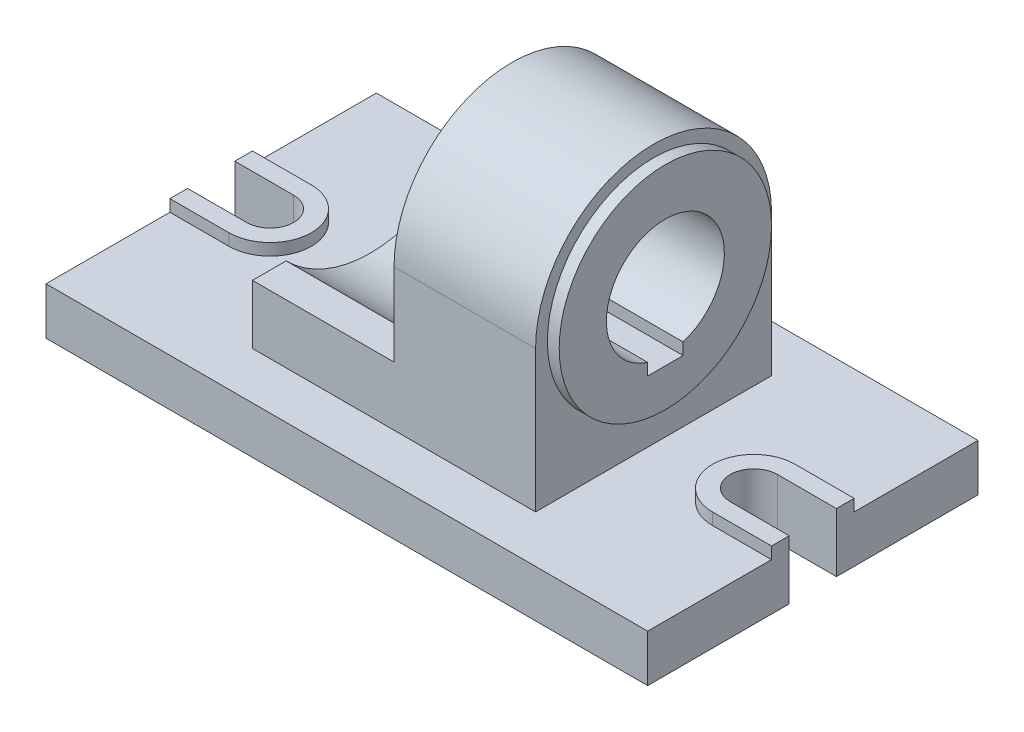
ISO-10303-21;
HEADER;
FILE_DESCRIPTION(('STEP AP214'),'2;1');
FILE_NAME('part.step','',(''),(''),'','','');
FILE_SCHEMA(('AUTOMOTIVE_DESIGN { 1 0 10303 214 1 1 1 1 }'));
ENDSEC;
DATA;
#1=APPLICATION_CONTEXT('core data for automotive mechanical design processes');
#2=APPLICATION_PROTOCOL_DEFINITION('international standard','automotive_design',2000,#1);
#3=PRODUCT_CONTEXT('',#1,'mechanical');
#4=PRODUCT('Part','Part','',(#3));
#5=PRODUCT_RELATED_PRODUCT_CATEGORY('part','',(#4));
#6=PRODUCT_DEFINITION_FORMATION('','',#4);
#7=PRODUCT_DEFINITION_CONTEXT('part definition',#1,'design');
#8=PRODUCT_DEFINITION('design','',#6,#7);
#9=PRODUCT_DEFINITION_SHAPE('','',#8);
#10=(LENGTH_UNIT() NAMED_UNIT(*) SI_UNIT(.MILLI.,.METRE.));
#11=(NAMED_UNIT(*) PLANE_ANGLE_UNIT() SI_UNIT($,.RADIAN.));
#12=(NAMED_UNIT(*) SI_UNIT($,.STERADIAN.) SOLID_ANGLE_UNIT());
#13=UNCERTAINTY_MEASURE_WITH_UNIT(LENGTH_MEASURE(1.E-05),#10,'distance_accuracy_value','');
#14=(GEOMETRIC_REPRESENTATION_CONTEXT(3) GLOBAL_UNCERTAINTY_ASSIGNED_CONTEXT((#13)) GLOBAL_UNIT_ASSIGNED_CONTEXT((#10,
#11,#12)) REPRESENTATION_CONTEXT('',''));
#15=CARTESIAN_POINT('',(0.,0.,0.));
#16=DIRECTION('',(0.,0.,1.));
#17=DIRECTION('',(1.,0.,0.));
#18=AXIS2_PLACEMENT_3D('',#15,#16,#17);
#19=CARTESIAN_POINT('',(24.,32.,0.));
#20=DIRECTION('',(1.,0.,0.));
#21=DIRECTION('',(0.,0.,-1.));
#22=AXIS2_PLACEMENT_3D('',#19,#20,#21);
#23=PLANE('',#22);
#24=CARTESIAN_POINT('',(24.,32.,0.));
#25=DIRECTION('',(1.,0.,0.));
#26=DIRECTION('',(0.,0.,-1.));
#27=AXIS2_PLACEMENT_3D('',#24,#25,#26);
#28=CIRCLE('',#27,20.);
#29=CARTESIAN_POINT('',(24.,32.,-20.));
#30=VERTEX_POINT('',#29);
#31=CARTESIAN_POINT('',(24.,32.,20.));
#32=VERTEX_POINT('',#31);
#33=EDGE_CURVE('E320',#30,#32,#28,.T.);
#34=ORIENTED_EDGE('',*,*,#33,.T.);
#35=DIRECTION('',(0.,-1.,0.));
#36=VECTOR('',#35,1.);
#37=CARTESIAN_POINT('',(24.,32.,20.));
#38=LINE('',#37,#36);
#39=CARTESIAN_POINT('',(24.,8.,20.));
#40=VERTEX_POINT('',#39);
#41=EDGE_CURVE('E323',#32,#40,#38,.T.);
#42=ORIENTED_EDGE('',*,*,#41,.T.);
#43=DIRECTION('',(0.,0.,-1.));
#44=VECTOR('',#43,1.);
#45=CARTESIAN_POINT('',(24.,8.,20.));
#46=LINE('',#45,#44);
#47=CARTESIAN_POINT('',(24.,8.,-20.));
#48=VERTEX_POINT('',#47);
#49=EDGE_CURVE('E55',#40,#48,#46,.T.);
#50=ORIENTED_EDGE('',*,*,#49,.T.);
#51=DIRECTION('',(0.,1.,0.));
#52=VECTOR('',#51,1.);
#53=CARTESIAN_POINT('',(24.,32.,-20.));
#54=LINE('',#53,#52);
#55=EDGE_CURVE('E327',#48,#30,#54,.T.);
#56=ORIENTED_EDGE('',*,*,#55,.T.);
#57=EDGE_LOOP('',(#34,#42,#50,#56));
#58=FACE_BOUND('',#57,.T.);
#59=CARTESIAN_POINT('',(24.,32.,0.));
#60=DIRECTION('',(1.,0.,0.));
#61=DIRECTION('',(0.,0.,-1.));
#62=AXIS2_PLACEMENT_3D('',#59,#60,#61);
#63=CIRCLE('',#62,18.);
#64=CARTESIAN_POINT('',(24.,32.,-18.));
#65=VERTEX_POINT('',#64);
#66=EDGE_CURVE('E272',#65,#65,#63,.T.);
#67=ORIENTED_EDGE('',*,*,#66,.F.);
#68=EDGE_LOOP('',(#67));
#69=FACE_BOUND('',#68,.T.);
#70=ADVANCED_FACE('F30',(#58,#69),#23,.T.);
#71=CARTESIAN_POINT('',(-41.,8.,0.));
#72=DIRECTION('',(0.,-1.,0.));
#73=DIRECTION('',(0.,0.,-1.));
#74=AXIS2_PLACEMENT_3D('',#71,#72,#73);
#75=PLANE('',#74);
#76=DIRECTION('',(1.,0.,0.));
#77=VECTOR('',#76,1.);
#78=CARTESIAN_POINT('',(-41.,8.,7.));
#79=LINE('',#78,#77);
#80=CARTESIAN_POINT('',(-51.,8.,7.));
#81=VERTEX_POINT('',#80);
#82=CARTESIAN_POINT('',(-41.,8.,7.));
#83=VERTEX_POINT('',#82);
#84=EDGE_CURVE('E345',#81,#83,#79,.T.);
#85=ORIENTED_EDGE('',*,*,#84,.F.);
#86=DIRECTION('',(0.,0.,1.));
#87=VECTOR('',#86,1.);
#88=CARTESIAN_POINT('',(-51.,8.,4.));
#89=LINE('',#88,#87);
#90=CARTESIAN_POINT('',(-51.,8.,28.));
#91=VERTEX_POINT('',#90);
#92=EDGE_CURVE('E461',#81,#91,#89,.T.);
#93=ORIENTED_EDGE('',*,*,#92,.T.);
#94=DIRECTION('',(1.,0.,0.));
#95=VECTOR('',#94,1.);
#96=CARTESIAN_POINT('',(-51.,8.,28.));
#97=LINE('',#96,#95);
#98=CARTESIAN_POINT('',(51.,8.,28.));
#99=VERTEX_POINT('',#98);
#100=EDGE_CURVE('E459',#91,#99,#97,.T.);
#101=ORIENTED_EDGE('',*,*,#100,.T.);
#102=DIRECTION('',(0.,0.,-1.));
#103=VECTOR('',#102,1.);
#104=CARTESIAN_POINT('',(51.,8.,4.));
#105=LINE('',#104,#103);
#106=CARTESIAN_POINT('',(51.,8.,7.));
#107=VERTEX_POINT('',#106);
#108=EDGE_CURVE('E456',#99,#107,#105,.T.);
#109=ORIENTED_EDGE('',*,*,#108,.T.);
#110=DIRECTION('',(1.,0.,0.));
#111=VECTOR('',#110,1.);
#112=CARTESIAN_POINT('',(41.,8.,7.));
#113=LINE('',#112,#111);
#114=CARTESIAN_POINT('',(41.,8.,7.));
#115=VERTEX_POINT('',#114);
#116=EDGE_CURVE('E412',#115,#107,#113,.T.);
#117=ORIENTED_EDGE('',*,*,#116,.F.);
#118=CARTESIAN_POINT('',(41.,8.,0.));
#119=DIRECTION('',(0.,1.,0.));
#120=DIRECTION('',(0.,0.,1.));
#121=AXIS2_PLACEMENT_3D('',#118,#119,#120);
#122=CIRCLE('',#121,7.);
#123=CARTESIAN_POINT('',(41.,8.,-7.));
#124=VERTEX_POINT('',#123);
#125=EDGE_CURVE('E386',#124,#115,#122,.T.);
#126=ORIENTED_EDGE('',*,*,#125,.F.);
#127=DIRECTION('',(-1.,0.,0.));
#128=VECTOR('',#127,1.);
#129=CARTESIAN_POINT('',(41.,8.,-7.));
#130=LINE('',#129,#128);
#131=CARTESIAN_POINT('',(51.,8.,-7.));
#132=VERTEX_POINT('',#131);
#133=EDGE_CURVE('E391',#132,#124,#130,.T.);
#134=ORIENTED_EDGE('',*,*,#133,.F.);
#135=DIRECTION('',(0.,0.,-1.));
#136=VECTOR('',#135,1.);
#137=CARTESIAN_POINT('',(51.,8.,-28.));
#138=LINE('',#137,#136);
#139=CARTESIAN_POINT('',(51.,8.,-28.));
#140=VERTEX_POINT('',#139);
#141=EDGE_CURVE('E420',#132,#140,#138,.T.);
#142=ORIENTED_EDGE('',*,*,#141,.T.);
#143=DIRECTION('',(-1.,0.,0.));
#144=VECTOR('',#143,1.);
#145=CARTESIAN_POINT('',(-51.,8.,-28.));
#146=LINE('',#145,#144);
#147=CARTESIAN_POINT('',(-51.,8.,-28.));
#148=VERTEX_POINT('',#147);
#149=EDGE_CURVE('E455',#140,#148,#146,.T.);
#150=ORIENTED_EDGE('',*,*,#149,.T.);
#151=DIRECTION('',(0.,0.,1.));
#152=VECTOR('',#151,1.);
#153=CARTESIAN_POINT('',(-51.,8.,-28.));
#154=LINE('',#153,#152);
#155=CARTESIAN_POINT('',(-51.,8.,-7.));
#156=VERTEX_POINT('',#155);
#157=EDGE_CURVE('E494',#148,#156,#154,.T.);
#158=ORIENTED_EDGE('',*,*,#157,.T.);
#159=DIRECTION('',(-1.,0.,0.));
#160=VECTOR('',#159,1.);
#161=CARTESIAN_POINT('',(-41.,8.,-7.));
#162=LINE('',#161,#160);
#163=CARTESIAN_POINT('',(-41.,8.,-7.));
#164=VERTEX_POINT('',#163);
#165=EDGE_CURVE('E350',#164,#156,#162,.T.);
#166=ORIENTED_EDGE('',*,*,#165,.F.);
#167=CARTESIAN_POINT('',(-41.,8.,0.));
#168=DIRECTION('',(0.,1.,0.));
#169=DIRECTION('',(0.,0.,-1.));
#170=AXIS2_PLACEMENT_3D('',#167,#168,#169);
#171=CIRCLE('',#170,7.);
#172=EDGE_CURVE('E370',#83,#164,#171,.T.);
#173=ORIENTED_EDGE('',*,*,#172,.F.);
#174=EDGE_LOOP('',(#85,#93,#101,#109,#117,#126,#134,#142,#150,#158,#166,#173));
#175=FACE_BOUND('',#174,.T.);
#176=DIRECTION('',(-1.,0.,0.));
#177=VECTOR('',#176,1.);
#178=CARTESIAN_POINT('',(24.,8.,20.));
#179=LINE('',#178,#177);
#180=CARTESIAN_POINT('',(-24.,8.,20.));
#181=VERTEX_POINT('',#180);
#182=EDGE_CURVE('E340',#40,#181,#179,.T.);
#183=ORIENTED_EDGE('',*,*,#182,.T.);
#184=DIRECTION('',(0.,0.,1.));
#185=VECTOR('',#184,1.);
#186=CARTESIAN_POINT('',(-24.,8.,20.));
#187=LINE('',#186,#185);
#188=CARTESIAN_POINT('',(-24.,8.,-20.));
#189=VERTEX_POINT('',#188);
#190=EDGE_CURVE('E279',#189,#181,#187,.T.);
#191=ORIENTED_EDGE('',*,*,#190,.F.);
#192=DIRECTION('',(-1.,0.,0.));
#193=VECTOR('',#192,1.);
#194=CARTESIAN_POINT('',(24.,8.,-20.));
#195=LINE('',#194,#193);
#196=EDGE_CURVE('E338',#48,#189,#195,.T.);
#197=ORIENTED_EDGE('',*,*,#196,.F.);
#198=ORIENTED_EDGE('',*,*,#49,.F.);
#199=EDGE_LOOP('',(#183,#191,#197,#198));
#200=FACE_BOUND('',#199,.T.);
#201=ADVANCED_FACE('F447',(#175,#200),#75,.F.);
#202=CARTESIAN_POINT('',(0.,32.,0.));
#203=DIRECTION('',(1.,0.,0.));
#204=DIRECTION('',(0.,0.,-1.));
#205=AXIS2_PLACEMENT_3D('',#202,#203,#204);
#206=PLANE('',#205);
#207=CARTESIAN_POINT('',(0.,32.,0.));
#208=DIRECTION('',(1.,0.,0.));
#209=DIRECTION('',(0.,0.,-1.));
#210=AXIS2_PLACEMENT_3D('',#207,#208,#209);
#211=CIRCLE('',#210,10.);
#212=CARTESIAN_POINT('',(0.,22.4606079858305,-3.));
#213=VERTEX_POINT('',#212);
#214=CARTESIAN_POINT('',(0.,22.4606079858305,3.));
#215=VERTEX_POINT('',#214);
#216=EDGE_CURVE('E307',#213,#215,#211,.T.);
#217=ORIENTED_EDGE('',*,*,#216,.T.);
#218=DIRECTION('',(0.,-1.,0.));
#219=VECTOR('',#218,1.);
#220=CARTESIAN_POINT('',(0.,22.4606079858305,3.));
#221=LINE('',#220,#219);
#222=CARTESIAN_POINT('',(0.,20.4606079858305,3.));
#223=VERTEX_POINT('',#222);
#224=EDGE_CURVE('E249',#215,#223,#221,.T.);
#225=ORIENTED_EDGE('',*,*,#224,.T.);
#226=DIRECTION('',(0.,0.,-1.));
#227=VECTOR('',#226,1.);
#228=CARTESIAN_POINT('',(0.,20.4606079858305,3.));
#229=LINE('',#228,#227);
#230=CARTESIAN_POINT('',(0.,20.4606079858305,-3.));
#231=VERTEX_POINT('',#230);
#232=EDGE_CURVE('E310',#223,#231,#229,.T.);
#233=ORIENTED_EDGE('',*,*,#232,.T.);
#234=DIRECTION('',(0.,1.,0.));
#235=VECTOR('',#234,1.);
#236=CARTESIAN_POINT('',(0.,20.4606079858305,-3.));
#237=LINE('',#236,#235);
#238=EDGE_CURVE('E313',#231,#213,#237,.T.);
#239=ORIENTED_EDGE('',*,*,#238,.T.);
#240=EDGE_LOOP('',(#217,#225,#233,#239));
#241=FACE_BOUND('',#240,.T.);
#242=DIRECTION('',(0.,0.,-1.));
#243=VECTOR('',#242,1.);
#244=CARTESIAN_POINT('',(0.,18.,20.));
#245=LINE('',#244,#243);
#246=CARTESIAN_POINT('',(0.,18.,20.));
#247=VERTEX_POINT('',#246);
#248=CARTESIAN_POINT('',(0.,18.,14.2828568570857));
#249=VERTEX_POINT('',#248);
#250=EDGE_CURVE('E276',#247,#249,#245,.T.);
#251=ORIENTED_EDGE('',*,*,#250,.F.);
#252=DIRECTION('',(0.,-1.,0.));
#253=VECTOR('',#252,1.);
#254=CARTESIAN_POINT('',(0.,32.,20.));
#255=LINE('',#254,#253);
#256=CARTESIAN_POINT('',(0.,32.,20.));
#257=VERTEX_POINT('',#256);
#258=EDGE_CURVE('E332',#257,#247,#255,.T.);
#259=ORIENTED_EDGE('',*,*,#258,.F.);
#260=CARTESIAN_POINT('',(0.,32.,0.));
#261=DIRECTION('',(1.,0.,0.));
#262=DIRECTION('',(0.,0.,-1.));
#263=AXIS2_PLACEMENT_3D('',#260,#261,#262);
#264=CIRCLE('',#263,20.);
#265=CARTESIAN_POINT('',(0.,32.,-20.));
#266=VERTEX_POINT('',#265);
#267=EDGE_CURVE('E252',#266,#257,#264,.T.);
#268=ORIENTED_EDGE('',*,*,#267,.F.);
#269=DIRECTION('',(0.,1.,0.));
#270=VECTOR('',#269,1.);
#271=CARTESIAN_POINT('',(0.,32.,-20.));
#272=LINE('',#271,#270);
#273=CARTESIAN_POINT('',(0.,18.,-20.));
#274=VERTEX_POINT('',#273);
#275=EDGE_CURVE('E324',#274,#266,#272,.T.);
#276=ORIENTED_EDGE('',*,*,#275,.F.);
#277=DIRECTION('',(0.,0.,-1.));
#278=VECTOR('',#277,1.);
#279=CARTESIAN_POINT('',(0.,18.,-20.));
#280=LINE('',#279,#278);
#281=CARTESIAN_POINT('',(0.,18.,-14.2828568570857));
#282=VERTEX_POINT('',#281);
#283=EDGE_CURVE('E283',#282,#274,#280,.T.);
#284=ORIENTED_EDGE('',*,*,#283,.F.);
#285=CARTESIAN_POINT('',(0.,32.,0.));
#286=DIRECTION('',(1.,0.,0.));
#287=DIRECTION('',(0.,0.,1.));
#288=AXIS2_PLACEMENT_3D('',#285,#286,#287);
#289=CIRCLE('',#288,20.);
#290=EDGE_CURVE('E295',#249,#282,#289,.T.);
#291=ORIENTED_EDGE('',*,*,#290,.F.);
#292=EDGE_LOOP('',(#251,#259,#268,#276,#284,#291));
#293=FACE_BOUND('',#292,.T.);
#294=ADVANCED_FACE('F583',(#241,#293),#206,.F.);
#295=CARTESIAN_POINT('',(-51.,8.,-28.));
#296=DIRECTION('',(1.,0.,0.));
#297=DIRECTION('',(0.,0.,-1.));
#298=AXIS2_PLACEMENT_3D('',#295,#296,#297);
#299=PLANE('',#298);
#300=DIRECTION('',(0.,0.,1.));
#301=VECTOR('',#300,1.);
#302=CARTESIAN_POINT('',(-51.,0.,-28.));
#303=LINE('',#302,#301);
#304=CARTESIAN_POINT('',(-51.,0.,-28.));
#305=VERTEX_POINT('',#304);
#306=CARTESIAN_POINT('',(-51.,0.,-4.00000000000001));
#307=VERTEX_POINT('',#306);
#308=EDGE_CURVE('E469',#305,#307,#303,.T.);
#309=ORIENTED_EDGE('',*,*,#308,.T.);
#310=DIRECTION('',(0.,-1.,0.));
#311=VECTOR('',#310,1.);
#312=CARTESIAN_POINT('',(-51.,8.,-4.00000000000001));
#313=LINE('',#312,#311);
#314=CARTESIAN_POINT('',(-51.,10.,-4.00000000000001));
#315=VERTEX_POINT('',#314);
#316=EDGE_CURVE('E11',#315,#307,#313,.T.);
#317=ORIENTED_EDGE('',*,*,#316,.F.);
#318=DIRECTION('',(0.,0.,1.));
#319=VECTOR('',#318,1.);
#320=CARTESIAN_POINT('',(-51.,10.,-7.));
#321=LINE('',#320,#319);
#322=CARTESIAN_POINT('',(-51.,10.,-7.));
#323=VERTEX_POINT('',#322);
#324=EDGE_CURVE('E361',#323,#315,#321,.T.);
#325=ORIENTED_EDGE('',*,*,#324,.F.);
#326=DIRECTION('',(0.,-1.,0.));
#327=VECTOR('',#326,1.);
#328=CARTESIAN_POINT('',(-51.,10.,-7.));
#329=LINE('',#328,#327);
#330=EDGE_CURVE('E367',#323,#156,#329,.T.);
#331=ORIENTED_EDGE('',*,*,#330,.T.);
#332=ORIENTED_EDGE('',*,*,#157,.F.);
#333=DIRECTION('',(0.,-1.,0.));
#334=VECTOR('',#333,1.);
#335=CARTESIAN_POINT('',(-51.,8.,-28.));
#336=LINE('',#335,#334);
#337=EDGE_CURVE('E457',#148,#305,#336,.T.);
#338=ORIENTED_EDGE('',*,*,#337,.T.);
#339=EDGE_LOOP('',(#309,#317,#325,#331,#332,#338));
#340=FACE_BOUND('',#339,.T.);
#341=ADVANCED_FACE('F32',(#340),#299,.F.);
#342=CARTESIAN_POINT('',(-41.,8.,-4.00000000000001));
#343=DIRECTION('',(0.,0.,-1.));
#344=DIRECTION('',(-1.,0.,0.));
#345=AXIS2_PLACEMENT_3D('',#342,#343,#344);
#346=PLANE('',#345);
#347=DIRECTION('',(1.,0.,0.));
#348=VECTOR('',#347,1.);
#349=CARTESIAN_POINT('',(-41.,0.,-4.00000000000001));
#350=LINE('',#349,#348);
#351=CARTESIAN_POINT('',(-41.,0.,-4.00000000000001));
#352=VERTEX_POINT('',#351);
#353=EDGE_CURVE('E472',#307,#352,#350,.T.);
#354=ORIENTED_EDGE('',*,*,#353,.T.);
#355=DIRECTION('',(0.,-1.,0.));
#356=VECTOR('',#355,1.);
#357=CARTESIAN_POINT('',(-41.,8.,-4.00000000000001));
#358=LINE('',#357,#356);
#359=CARTESIAN_POINT('',(-41.,10.,-4.00000000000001));
#360=VERTEX_POINT('',#359);
#361=EDGE_CURVE('E39',#360,#352,#358,.T.);
#362=ORIENTED_EDGE('',*,*,#361,.F.);
#363=DIRECTION('',(1.,0.,0.));
#364=VECTOR('',#363,1.);
#365=CARTESIAN_POINT('',(-51.,10.,-4.00000000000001));
#366=LINE('',#365,#364);
#367=EDGE_CURVE('E364',#315,#360,#366,.T.);
#368=ORIENTED_EDGE('',*,*,#367,.F.);
#369=ORIENTED_EDGE('',*,*,#316,.T.);
#370=EDGE_LOOP('',(#354,#362,#368,#369));
#371=FACE_BOUND('',#370,.T.);
#372=ADVANCED_FACE('F547',(#371),#346,.F.);
#373=CARTESIAN_POINT('',(-41.,8.,0.));
#374=DIRECTION('',(0.,-1.,0.));
#375=DIRECTION('',(0.,0.,-1.));
#376=AXIS2_PLACEMENT_3D('',#373,#374,#375);
#377=CYLINDRICAL_SURFACE('',#376,4.00000000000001);
#378=CARTESIAN_POINT('',(-41.,0.,0.));
#379=DIRECTION('',(0.,-1.,0.));
#380=DIRECTION('',(0.,0.,-1.));
#381=AXIS2_PLACEMENT_3D('',#378,#379,#380);
#382=CIRCLE('',#381,4.00000000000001);
#383=CARTESIAN_POINT('',(-41.,0.,4.00000000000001));
#384=VERTEX_POINT('',#383);
#385=EDGE_CURVE('E474',#352,#384,#382,.T.);
#386=ORIENTED_EDGE('',*,*,#385,.T.);
#387=DIRECTION('',(0.,-1.,0.));
#388=VECTOR('',#387,1.);
#389=CARTESIAN_POINT('',(-41.,8.,4.00000000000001));
#390=LINE('',#389,#388);
#391=CARTESIAN_POINT('',(-41.,10.,4.00000000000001));
#392=VERTEX_POINT('',#391);
#393=EDGE_CURVE('E519',#392,#384,#390,.T.);
#394=ORIENTED_EDGE('',*,*,#393,.F.);
#395=CARTESIAN_POINT('',(-41.,10.,0.));
#396=DIRECTION('',(0.,-1.,0.));
#397=DIRECTION('',(0.,0.,-1.));
#398=AXIS2_PLACEMENT_3D('',#395,#396,#397);
#399=CIRCLE('',#398,4.00000000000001);
#400=EDGE_CURVE('E346',#360,#392,#399,.T.);
#401=ORIENTED_EDGE('',*,*,#400,.F.);
#402=ORIENTED_EDGE('',*,*,#361,.T.);
#403=EDGE_LOOP('',(#386,#394,#401,#402));
#404=FACE_BOUND('',#403,.T.);
#405=ADVANCED_FACE('F525',(#404),#377,.F.);
#406=CARTESIAN_POINT('',(-51.,8.,4.));
#407=DIRECTION('',(0.,0.,1.));
#408=DIRECTION('',(1.,0.,0.));
#409=AXIS2_PLACEMENT_3D('',#406,#407,#408);
#410=PLANE('',#409);
#411=DIRECTION('',(-1.,0.,0.));
#412=VECTOR('',#411,1.);
#413=CARTESIAN_POINT('',(-51.,0.,4.));
#414=LINE('',#413,#412);
#415=CARTESIAN_POINT('',(-51.,0.,4.));
#416=VERTEX_POINT('',#415);
#417=EDGE_CURVE('E476',#384,#416,#414,.T.);
#418=ORIENTED_EDGE('',*,*,#417,.T.);
#419=DIRECTION('',(0.,-1.,0.));
#420=VECTOR('',#419,1.);
#421=CARTESIAN_POINT('',(-51.,8.,4.));
#422=LINE('',#421,#420);
#423=CARTESIAN_POINT('',(-51.,10.,4.));
#424=VERTEX_POINT('',#423);
#425=EDGE_CURVE('E516',#424,#416,#422,.T.);
#426=ORIENTED_EDGE('',*,*,#425,.F.);
#427=DIRECTION('',(-1.,0.,0.));
#428=VECTOR('',#427,1.);
#429=CARTESIAN_POINT('',(-51.,10.,4.));
#430=LINE('',#429,#428);
#431=EDGE_CURVE('E349',#392,#424,#430,.T.);
#432=ORIENTED_EDGE('',*,*,#431,.F.);
#433=ORIENTED_EDGE('',*,*,#393,.T.);
#434=EDGE_LOOP('',(#418,#426,#432,#433));
#435=FACE_BOUND('',#434,.T.);
#436=ADVANCED_FACE('F535',(#435),#410,.F.);
#437=CARTESIAN_POINT('',(-51.,8.,4.));
#438=DIRECTION('',(1.,0.,0.));
#439=DIRECTION('',(0.,0.,-1.));
#440=AXIS2_PLACEMENT_3D('',#437,#438,#439);
#441=PLANE('',#440);
#442=DIRECTION('',(0.,0.,1.));
#443=VECTOR('',#442,1.);
#444=CARTESIAN_POINT('',(-51.,0.,4.));
#445=LINE('',#444,#443);
#446=CARTESIAN_POINT('',(-51.,0.,28.));
#447=VERTEX_POINT('',#446);
#448=EDGE_CURVE('E478',#416,#447,#445,.T.);
#449=ORIENTED_EDGE('',*,*,#448,.T.);
#450=DIRECTION('',(0.,-1.,0.));
#451=VECTOR('',#450,1.);
#452=CARTESIAN_POINT('',(-51.,8.,28.));
#453=LINE('',#452,#451);
#454=EDGE_CURVE('E513',#91,#447,#453,.T.);
#455=ORIENTED_EDGE('',*,*,#454,.F.);
#456=ORIENTED_EDGE('',*,*,#92,.F.);
#457=DIRECTION('',(0.,-1.,0.));
#458=VECTOR('',#457,1.);
#459=CARTESIAN_POINT('',(-51.,10.,7.));
#460=LINE('',#459,#458);
#461=CARTESIAN_POINT('',(-51.,10.,7.));
#462=VERTEX_POINT('',#461);
#463=EDGE_CURVE('E383',#462,#81,#460,.T.);
#464=ORIENTED_EDGE('',*,*,#463,.F.);
#465=DIRECTION('',(0.,0.,1.));
#466=VECTOR('',#465,1.);
#467=CARTESIAN_POINT('',(-51.,10.,7.));
#468=LINE('',#467,#466);
#469=EDGE_CURVE('E353',#424,#462,#468,.T.);
#470=ORIENTED_EDGE('',*,*,#469,.F.);
#471=ORIENTED_EDGE('',*,*,#425,.T.);
#472=EDGE_LOOP('',(#449,#455,#456,#464,#470,#471));
#473=FACE_BOUND('',#472,.T.);
#474=ADVANCED_FACE('F539',(#473),#441,.F.);
#475=CARTESIAN_POINT('',(-51.,8.,28.));
#476=DIRECTION('',(0.,0.,-1.));
#477=DIRECTION('',(-1.,0.,0.));
#478=AXIS2_PLACEMENT_3D('',#475,#476,#477);
#479=PLANE('',#478);
#480=DIRECTION('',(1.,0.,0.));
#481=VECTOR('',#480,1.);
#482=CARTESIAN_POINT('',(-51.,0.,28.));
#483=LINE('',#482,#481);
#484=CARTESIAN_POINT('',(51.,0.,28.));
#485=VERTEX_POINT('',#484);
#486=EDGE_CURVE('E480',#447,#485,#483,.T.);
#487=ORIENTED_EDGE('',*,*,#486,.T.);
#488=DIRECTION('',(0.,-1.,0.));
#489=VECTOR('',#488,1.);
#490=CARTESIAN_POINT('',(51.,8.,28.));
#491=LINE('',#490,#489);
#492=EDGE_CURVE('E510',#99,#485,#491,.T.);
#493=ORIENTED_EDGE('',*,*,#492,.F.);
#494=ORIENTED_EDGE('',*,*,#100,.F.);
#495=ORIENTED_EDGE('',*,*,#454,.T.);
#496=EDGE_LOOP('',(#487,#493,#494,#495));
#497=FACE_BOUND('',#496,.T.);
#498=ADVANCED_FACE('F786',(#497),#479,.F.);
#499=CARTESIAN_POINT('',(51.,8.,4.));
#500=DIRECTION('',(-1.,0.,0.));
#501=DIRECTION('',(0.,0.,1.));
#502=AXIS2_PLACEMENT_3D('',#499,#500,#501);
#503=PLANE('',#502);
#504=DIRECTION('',(0.,0.,-1.));
#505=VECTOR('',#504,1.);
#506=CARTESIAN_POINT('',(51.,0.,4.));
#507=LINE('',#506,#505);
#508=CARTESIAN_POINT('',(51.,0.,4.));
#509=VERTEX_POINT('',#508);
#510=EDGE_CURVE('E482',#485,#509,#507,.T.);
#511=ORIENTED_EDGE('',*,*,#510,.T.);
#512=DIRECTION('',(0.,-1.,0.));
#513=VECTOR('',#512,1.);
#514=CARTESIAN_POINT('',(51.,8.,4.));
#515=LINE('',#514,#513);
#516=CARTESIAN_POINT('',(51.,10.,4.));
#517=VERTEX_POINT('',#516);
#518=EDGE_CURVE('E507',#517,#509,#515,.T.);
#519=ORIENTED_EDGE('',*,*,#518,.F.);
#520=DIRECTION('',(0.,0.,-1.));
#521=VECTOR('',#520,1.);
#522=CARTESIAN_POINT('',(51.,10.,7.));
#523=LINE('',#522,#521);
#524=CARTESIAN_POINT('',(51.,10.,7.));
#525=VERTEX_POINT('',#524);
#526=EDGE_CURVE('E393',#525,#517,#523,.T.);
#527=ORIENTED_EDGE('',*,*,#526,.F.);
#528=DIRECTION('',(0.,-1.,0.));
#529=VECTOR('',#528,1.);
#530=CARTESIAN_POINT('',(51.,10.,7.));
#531=LINE('',#530,#529);
#532=EDGE_CURVE('E423',#525,#107,#531,.T.);
#533=ORIENTED_EDGE('',*,*,#532,.T.);
#534=ORIENTED_EDGE('',*,*,#108,.F.);
#535=ORIENTED_EDGE('',*,*,#492,.T.);
#536=EDGE_LOOP('',(#511,#519,#527,#533,#534,#535));
#537=FACE_BOUND('',#536,.T.);
#538=ADVANCED_FACE('F794',(#537),#503,.F.);
#539=CARTESIAN_POINT('',(51.,8.,4.));
#540=DIRECTION('',(0.,0.,1.));
#541=DIRECTION('',(1.,0.,0.));
#542=AXIS2_PLACEMENT_3D('',#539,#540,#541);
#543=PLANE('',#542);
#544=DIRECTION('',(-1.,0.,0.));
#545=VECTOR('',#544,1.);
#546=CARTESIAN_POINT('',(51.,0.,4.));
#547=LINE('',#546,#545);
#548=CARTESIAN_POINT('',(41.,0.,4.00000000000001));
#549=VERTEX_POINT('',#548);
#550=EDGE_CURVE('E484',#509,#549,#547,.T.);
#551=ORIENTED_EDGE('',*,*,#550,.T.);
#552=DIRECTION('',(0.,-1.,0.));
#553=VECTOR('',#552,1.);
#554=CARTESIAN_POINT('',(41.,8.,4.00000000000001));
#555=LINE('',#554,#553);
#556=CARTESIAN_POINT('',(41.,10.,4.00000000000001));
#557=VERTEX_POINT('',#556);
#558=EDGE_CURVE('E504',#557,#549,#555,.T.);
#559=ORIENTED_EDGE('',*,*,#558,.F.);
#560=DIRECTION('',(-1.,0.,0.));
#561=VECTOR('',#560,1.);
#562=CARTESIAN_POINT('',(51.,10.,4.));
#563=LINE('',#562,#561);
#564=EDGE_CURVE('E396',#517,#557,#563,.T.);
#565=ORIENTED_EDGE('',*,*,#564,.F.);
#566=ORIENTED_EDGE('',*,*,#518,.T.);
#567=EDGE_LOOP('',(#551,#559,#565,#566));
#568=FACE_BOUND('',#567,.T.);
#569=ADVANCED_FACE('F802',(#568),#543,.F.);
#570=CARTESIAN_POINT('',(41.,8.,0.));
#571=DIRECTION('',(0.,-1.,0.));
#572=DIRECTION('',(0.,0.,-1.));
#573=AXIS2_PLACEMENT_3D('',#570,#571,#572);
#574=CYLINDRICAL_SURFACE('',#573,4.00000000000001);
#575=CARTESIAN_POINT('',(41.,0.,0.));
#576=DIRECTION('',(0.,-1.,0.));
#577=DIRECTION('',(0.,0.,1.));
#578=AXIS2_PLACEMENT_3D('',#575,#576,#577);
#579=CIRCLE('',#578,4.00000000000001);
#580=CARTESIAN_POINT('',(41.,0.,-4.00000000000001));
#581=VERTEX_POINT('',#580);
#582=EDGE_CURVE('E486',#549,#581,#579,.T.);
#583=ORIENTED_EDGE('',*,*,#582,.T.);
#584=DIRECTION('',(0.,-1.,0.));
#585=VECTOR('',#584,1.);
#586=CARTESIAN_POINT('',(41.,8.,-4.00000000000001));
#587=LINE('',#586,#585);
#588=CARTESIAN_POINT('',(41.,10.,-4.00000000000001));
#589=VERTEX_POINT('',#588);
#590=EDGE_CURVE('E501',#589,#581,#587,.T.);
#591=ORIENTED_EDGE('',*,*,#590,.F.);
#592=CARTESIAN_POINT('',(41.,10.,0.));
#593=DIRECTION('',(0.,-1.,0.));
#594=DIRECTION('',(0.,0.,1.));
#595=AXIS2_PLACEMENT_3D('',#592,#593,#594);
#596=CIRCLE('',#595,4.00000000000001);
#597=EDGE_CURVE('E399',#557,#589,#596,.T.);
#598=ORIENTED_EDGE('',*,*,#597,.F.);
#599=ORIENTED_EDGE('',*,*,#558,.T.);
#600=EDGE_LOOP('',(#583,#591,#598,#599));
#601=FACE_BOUND('',#600,.T.);
#602=ADVANCED_FACE('F810',(#601),#574,.F.);
#603=CARTESIAN_POINT('',(41.,8.,-4.00000000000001));
#604=DIRECTION('',(0.,0.,-1.));
#605=DIRECTION('',(-1.,0.,0.));
#606=AXIS2_PLACEMENT_3D('',#603,#604,#605);
#607=PLANE('',#606);
#608=DIRECTION('',(1.,0.,0.));
#609=VECTOR('',#608,1.);
#610=CARTESIAN_POINT('',(41.,0.,-4.00000000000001));
#611=LINE('',#610,#609);
#612=CARTESIAN_POINT('',(51.,0.,-4.00000000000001));
#613=VERTEX_POINT('',#612);
#614=EDGE_CURVE('E488',#581,#613,#611,.T.);
#615=ORIENTED_EDGE('',*,*,#614,.T.);
#616=DIRECTION('',(0.,-1.,0.));
#617=VECTOR('',#616,1.);
#618=CARTESIAN_POINT('',(51.,8.,-4.00000000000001));
#619=LINE('',#618,#617);
#620=CARTESIAN_POINT('',(51.,10.,-4.00000000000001));
#621=VERTEX_POINT('',#620);
#622=EDGE_CURVE('E498',#621,#613,#619,.T.);
#623=ORIENTED_EDGE('',*,*,#622,.F.);
#624=DIRECTION('',(1.,0.,0.));
#625=VECTOR('',#624,1.);
#626=CARTESIAN_POINT('',(46.744562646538,10.,-4.00000000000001));
#627=LINE('',#626,#625);
#628=EDGE_CURVE('E402',#589,#621,#627,.T.);
#629=ORIENTED_EDGE('',*,*,#628,.F.);
#630=ORIENTED_EDGE('',*,*,#590,.T.);
#631=EDGE_LOOP('',(#615,#623,#629,#630));
#632=FACE_BOUND('',#631,.T.);
#633=ADVANCED_FACE('F818',(#632),#607,.F.);
#634=CARTESIAN_POINT('',(51.,8.,-28.));
#635=DIRECTION('',(-1.,0.,0.));
#636=DIRECTION('',(0.,0.,1.));
#637=AXIS2_PLACEMENT_3D('',#634,#635,#636);
#638=PLANE('',#637);
#639=DIRECTION('',(0.,0.,-1.));
#640=VECTOR('',#639,1.);
#641=CARTESIAN_POINT('',(51.,0.,-28.));
#642=LINE('',#641,#640);
#643=CARTESIAN_POINT('',(51.,0.,-28.));
#644=VERTEX_POINT('',#643);
#645=EDGE_CURVE('E490',#613,#644,#642,.T.);
#646=ORIENTED_EDGE('',*,*,#645,.T.);
#647=DIRECTION('',(0.,-1.,0.));
#648=VECTOR('',#647,1.);
#649=CARTESIAN_POINT('',(51.,8.,-28.));
#650=LINE('',#649,#648);
#651=EDGE_CURVE('E453',#140,#644,#650,.T.);
#652=ORIENTED_EDGE('',*,*,#651,.F.);
#653=ORIENTED_EDGE('',*,*,#141,.F.);
#654=DIRECTION('',(0.,-1.,0.));
#655=VECTOR('',#654,1.);
#656=CARTESIAN_POINT('',(51.,10.,-7.));
#657=LINE('',#656,#655);
#658=CARTESIAN_POINT('',(51.,10.,-7.));
#659=VERTEX_POINT('',#658);
#660=EDGE_CURVE('E427',#659,#132,#657,.T.);
#661=ORIENTED_EDGE('',*,*,#660,.F.);
#662=DIRECTION('',(0.,0.,-1.));
#663=VECTOR('',#662,1.);
#664=CARTESIAN_POINT('',(51.,10.,-7.));
#665=LINE('',#664,#663);
#666=EDGE_CURVE('E405',#621,#659,#665,.T.);
#667=ORIENTED_EDGE('',*,*,#666,.F.);
#668=ORIENTED_EDGE('',*,*,#622,.T.);
#669=EDGE_LOOP('',(#646,#652,#653,#661,#667,#668));
#670=FACE_BOUND('',#669,.T.);
#671=ADVANCED_FACE('F450',(#670),#638,.F.);
#672=CARTESIAN_POINT('',(-51.,8.,-28.));
#673=DIRECTION('',(0.,0.,1.));
#674=DIRECTION('',(1.,0.,0.));
#675=AXIS2_PLACEMENT_3D('',#672,#673,#674);
#676=PLANE('',#675);
#677=DIRECTION('',(-1.,0.,0.));
#678=VECTOR('',#677,1.);
#679=CARTESIAN_POINT('',(-51.,0.,-28.));
#680=LINE('',#679,#678);
#681=EDGE_CURVE('E492',#644,#305,#680,.T.);
#682=ORIENTED_EDGE('',*,*,#681,.T.);
#683=ORIENTED_EDGE('',*,*,#337,.F.);
#684=ORIENTED_EDGE('',*,*,#149,.F.);
#685=ORIENTED_EDGE('',*,*,#651,.T.);
#686=EDGE_LOOP('',(#682,#683,#684,#685));
#687=FACE_BOUND('',#686,.T.);
#688=ADVANCED_FACE('F555',(#687),#676,.F.);
#689=CARTESIAN_POINT('',(-41.,0.,0.));
#690=DIRECTION('',(0.,-1.,0.));
#691=DIRECTION('',(0.,0.,-1.));
#692=AXIS2_PLACEMENT_3D('',#689,#690,#691);
#693=PLANE('',#692);
#694=ORIENTED_EDGE('',*,*,#308,.F.);
#695=ORIENTED_EDGE('',*,*,#681,.F.);
#696=ORIENTED_EDGE('',*,*,#645,.F.);
#697=ORIENTED_EDGE('',*,*,#614,.F.);
#698=ORIENTED_EDGE('',*,*,#582,.F.);
#699=ORIENTED_EDGE('',*,*,#550,.F.);
#700=ORIENTED_EDGE('',*,*,#510,.F.);
#701=ORIENTED_EDGE('',*,*,#486,.F.);
#702=ORIENTED_EDGE('',*,*,#448,.F.);
#703=ORIENTED_EDGE('',*,*,#417,.F.);
#704=ORIENTED_EDGE('',*,*,#385,.F.);
#705=ORIENTED_EDGE('',*,*,#353,.F.);
#706=EDGE_LOOP('',(#694,#695,#696,#697,#698,#699,#700,#701,#702,#703,#704,#705));
#707=FACE_BOUND('',#706,.T.);
#708=ADVANCED_FACE('F531',(#707),#693,.T.);
#709=CARTESIAN_POINT('',(41.,10.,0.));
#710=DIRECTION('',(0.,-1.,0.));
#711=DIRECTION('',(0.,0.,-1.));
#712=AXIS2_PLACEMENT_3D('',#709,#710,#711);
#713=CYLINDRICAL_SURFACE('',#712,7.);
#714=ORIENTED_EDGE('',*,*,#125,.T.);
#715=DIRECTION('',(0.,-1.,0.));
#716=VECTOR('',#715,1.);
#717=CARTESIAN_POINT('',(41.,10.,7.));
#718=LINE('',#717,#716);
#719=CARTESIAN_POINT('',(41.,10.,7.));
#720=VERTEX_POINT('',#719);
#721=EDGE_CURVE('E426',#720,#115,#718,.T.);
#722=ORIENTED_EDGE('',*,*,#721,.F.);
#723=CARTESIAN_POINT('',(41.,10.,0.));
#724=DIRECTION('',(0.,1.,0.));
#725=DIRECTION('',(0.,0.,1.));
#726=AXIS2_PLACEMENT_3D('',#723,#724,#725);
#727=CIRCLE('',#726,7.);
#728=CARTESIAN_POINT('',(41.,10.,-7.));
#729=VERTEX_POINT('',#728);
#730=EDGE_CURVE('E387',#729,#720,#727,.T.);
#731=ORIENTED_EDGE('',*,*,#730,.F.);
#732=DIRECTION('',(0.,-1.,0.));
#733=VECTOR('',#732,1.);
#734=CARTESIAN_POINT('',(41.,10.,-7.));
#735=LINE('',#734,#733);
#736=EDGE_CURVE('E409',#729,#124,#735,.T.);
#737=ORIENTED_EDGE('',*,*,#736,.T.);
#738=EDGE_LOOP('',(#714,#722,#731,#737));
#739=FACE_BOUND('',#738,.T.);
#740=ADVANCED_FACE('F441',(#739),#713,.T.);
#741=CARTESIAN_POINT('',(41.,10.,7.));
#742=DIRECTION('',(0.,0.,-1.));
#743=DIRECTION('',(-1.,0.,0.));
#744=AXIS2_PLACEMENT_3D('',#741,#742,#743);
#745=PLANE('',#744);
#746=ORIENTED_EDGE('',*,*,#116,.T.);
#747=ORIENTED_EDGE('',*,*,#532,.F.);
#748=DIRECTION('',(1.,0.,0.));
#749=VECTOR('',#748,1.);
#750=CARTESIAN_POINT('',(41.,10.,7.));
#751=LINE('',#750,#749);
#752=EDGE_CURVE('E390',#720,#525,#751,.T.);
#753=ORIENTED_EDGE('',*,*,#752,.F.);
#754=ORIENTED_EDGE('',*,*,#721,.T.);
#755=EDGE_LOOP('',(#746,#747,#753,#754));
#756=FACE_BOUND('',#755,.T.);
#757=ADVANCED_FACE('F849',(#756),#745,.F.);
#758=CARTESIAN_POINT('',(41.,10.,-7.));
#759=DIRECTION('',(0.,0.,1.));
#760=DIRECTION('',(1.,0.,0.));
#761=AXIS2_PLACEMENT_3D('',#758,#759,#760);
#762=PLANE('',#761);
#763=ORIENTED_EDGE('',*,*,#133,.T.);
#764=ORIENTED_EDGE('',*,*,#736,.F.);
#765=DIRECTION('',(-1.,0.,0.));
#766=VECTOR('',#765,1.);
#767=CARTESIAN_POINT('',(41.,10.,-7.));
#768=LINE('',#767,#766);
#769=EDGE_CURVE('E407',#659,#729,#768,.T.);
#770=ORIENTED_EDGE('',*,*,#769,.F.);
#771=ORIENTED_EDGE('',*,*,#660,.T.);
#772=EDGE_LOOP('',(#763,#764,#770,#771));
#773=FACE_BOUND('',#772,.T.);
#774=ADVANCED_FACE('F443',(#773),#762,.F.);
#775=CARTESIAN_POINT('',(41.,10.,0.));
#776=DIRECTION('',(0.,1.,0.));
#777=DIRECTION('',(0.,0.,1.));
#778=AXIS2_PLACEMENT_3D('',#775,#776,#777);
#779=PLANE('',#778);
#780=ORIENTED_EDGE('',*,*,#730,.T.);
#781=ORIENTED_EDGE('',*,*,#752,.T.);
#782=ORIENTED_EDGE('',*,*,#526,.T.);
#783=ORIENTED_EDGE('',*,*,#564,.T.);
#784=ORIENTED_EDGE('',*,*,#597,.T.);
#785=ORIENTED_EDGE('',*,*,#628,.T.);
#786=ORIENTED_EDGE('',*,*,#666,.T.);
#787=ORIENTED_EDGE('',*,*,#769,.T.);
#788=EDGE_LOOP('',(#780,#781,#782,#783,#784,#785,#786,#787));
#789=FACE_BOUND('',#788,.T.);
#790=ADVANCED_FACE('F568',(#789),#779,.T.);
#791=CARTESIAN_POINT('',(-41.,10.,7.));
#792=DIRECTION('',(0.,0.,-1.));
#793=DIRECTION('',(-1.,0.,0.));
#794=AXIS2_PLACEMENT_3D('',#791,#792,#793);
#795=PLANE('',#794);
#796=ORIENTED_EDGE('',*,*,#84,.T.);
#797=DIRECTION('',(0.,-1.,0.));
#798=VECTOR('',#797,1.);
#799=CARTESIAN_POINT('',(-41.,10.,7.));
#800=LINE('',#799,#798);
#801=CARTESIAN_POINT('',(-41.,10.,7.));
#802=VERTEX_POINT('',#801);
#803=EDGE_CURVE('E380',#802,#83,#800,.T.);
#804=ORIENTED_EDGE('',*,*,#803,.F.);
#805=DIRECTION('',(1.,0.,0.));
#806=VECTOR('',#805,1.);
#807=CARTESIAN_POINT('',(-41.,10.,7.));
#808=LINE('',#807,#806);
#809=EDGE_CURVE('E355',#462,#802,#808,.T.);
#810=ORIENTED_EDGE('',*,*,#809,.F.);
#811=ORIENTED_EDGE('',*,*,#463,.T.);
#812=EDGE_LOOP('',(#796,#804,#810,#811));
#813=FACE_BOUND('',#812,.T.);
#814=ADVANCED_FACE('F566',(#813),#795,.F.);
#815=CARTESIAN_POINT('',(-41.,10.,0.));
#816=DIRECTION('',(0.,-1.,0.));
#817=DIRECTION('',(0.,0.,-1.));
#818=AXIS2_PLACEMENT_3D('',#815,#816,#817);
#819=CYLINDRICAL_SURFACE('',#818,7.);
#820=ORIENTED_EDGE('',*,*,#172,.T.);
#821=DIRECTION('',(0.,-1.,0.));
#822=VECTOR('',#821,1.);
#823=CARTESIAN_POINT('',(-41.,10.,-7.));
#824=LINE('',#823,#822);
#825=CARTESIAN_POINT('',(-41.,10.,-7.));
#826=VERTEX_POINT('',#825);
#827=EDGE_CURVE('E377',#826,#164,#824,.T.);
#828=ORIENTED_EDGE('',*,*,#827,.F.);
#829=CARTESIAN_POINT('',(-41.,10.,0.));
#830=DIRECTION('',(0.,1.,0.));
#831=DIRECTION('',(0.,0.,-1.));
#832=AXIS2_PLACEMENT_3D('',#829,#830,#831);
#833=CIRCLE('',#832,7.);
#834=EDGE_CURVE('E357',#802,#826,#833,.T.);
#835=ORIENTED_EDGE('',*,*,#834,.F.);
#836=ORIENTED_EDGE('',*,*,#803,.T.);
#837=EDGE_LOOP('',(#820,#828,#835,#836));
#838=FACE_BOUND('',#837,.T.);
#839=ADVANCED_FACE('F564',(#838),#819,.T.);
#840=CARTESIAN_POINT('',(-41.,10.,-7.));
#841=DIRECTION('',(0.,0.,1.));
#842=DIRECTION('',(1.,0.,0.));
#843=AXIS2_PLACEMENT_3D('',#840,#841,#842);
#844=PLANE('',#843);
#845=ORIENTED_EDGE('',*,*,#165,.T.);
#846=ORIENTED_EDGE('',*,*,#330,.F.);
#847=DIRECTION('',(-1.,0.,0.));
#848=VECTOR('',#847,1.);
#849=CARTESIAN_POINT('',(-41.,10.,-7.));
#850=LINE('',#849,#848);
#851=EDGE_CURVE('E359',#826,#323,#850,.T.);
#852=ORIENTED_EDGE('',*,*,#851,.F.);
#853=ORIENTED_EDGE('',*,*,#827,.T.);
#854=EDGE_LOOP('',(#845,#846,#852,#853));
#855=FACE_BOUND('',#854,.T.);
#856=ADVANCED_FACE('F559',(#855),#844,.F.);
#857=CARTESIAN_POINT('',(-41.,10.,0.));
#858=DIRECTION('',(0.,-1.,0.));
#859=DIRECTION('',(0.,0.,-1.));
#860=AXIS2_PLACEMENT_3D('',#857,#858,#859);
#861=PLANE('',#860);
#862=ORIENTED_EDGE('',*,*,#400,.T.);
#863=ORIENTED_EDGE('',*,*,#431,.T.);
#864=ORIENTED_EDGE('',*,*,#469,.T.);
#865=ORIENTED_EDGE('',*,*,#809,.T.);
#866=ORIENTED_EDGE('',*,*,#834,.T.);
#867=ORIENTED_EDGE('',*,*,#851,.T.);
#868=ORIENTED_EDGE('',*,*,#324,.T.);
#869=ORIENTED_EDGE('',*,*,#367,.T.);
#870=EDGE_LOOP('',(#862,#863,#864,#865,#866,#867,#868,#869));
#871=FACE_BOUND('',#870,.T.);
#872=ADVANCED_FACE('F544',(#871),#861,.F.);
#873=CARTESIAN_POINT('',(24.,32.,0.));
#874=DIRECTION('',(-1.,0.,0.));
#875=DIRECTION('',(0.,0.,1.));
#876=AXIS2_PLACEMENT_3D('',#873,#874,#875);
#877=CYLINDRICAL_SURFACE('',#876,20.);
#878=ORIENTED_EDGE('',*,*,#267,.T.);
#879=DIRECTION('',(-1.,0.,0.));
#880=VECTOR('',#879,1.);
#881=CARTESIAN_POINT('',(24.,32.,20.));
#882=LINE('',#881,#880);
#883=EDGE_CURVE('E342',#32,#257,#882,.T.);
#884=ORIENTED_EDGE('',*,*,#883,.F.);
#885=ORIENTED_EDGE('',*,*,#33,.F.);
#886=DIRECTION('',(-1.,0.,0.));
#887=VECTOR('',#886,1.);
#888=CARTESIAN_POINT('',(24.,32.,-20.));
#889=LINE('',#888,#887);
#890=EDGE_CURVE('E329',#30,#266,#889,.T.);
#891=ORIENTED_EDGE('',*,*,#890,.T.);
#892=EDGE_LOOP('',(#878,#884,#885,#891));
#893=FACE_BOUND('',#892,.T.);
#894=ADVANCED_FACE('F598',(#893),#877,.T.);
#895=CARTESIAN_POINT('',(24.,32.,20.));
#896=DIRECTION('',(0.,0.,-1.));
#897=DIRECTION('',(-1.,0.,0.));
#898=AXIS2_PLACEMENT_3D('',#895,#896,#897);
#899=PLANE('',#898);
#900=ORIENTED_EDGE('',*,*,#258,.T.);
#901=DIRECTION('',(1.,0.,0.));
#902=VECTOR('',#901,1.);
#903=CARTESIAN_POINT('',(-24.,18.,20.));
#904=LINE('',#903,#902);
#905=CARTESIAN_POINT('',(-24.,18.,20.));
#906=VERTEX_POINT('',#905);
#907=EDGE_CURVE('E305',#906,#247,#904,.T.);
#908=ORIENTED_EDGE('',*,*,#907,.F.);
#909=DIRECTION('',(0.,1.,0.));
#910=VECTOR('',#909,1.);
#911=CARTESIAN_POINT('',(-24.,8.,20.));
#912=LINE('',#911,#910);
#913=EDGE_CURVE('E282',#181,#906,#912,.T.);
#914=ORIENTED_EDGE('',*,*,#913,.F.);
#915=ORIENTED_EDGE('',*,*,#182,.F.);
#916=ORIENTED_EDGE('',*,*,#41,.F.);
#917=ORIENTED_EDGE('',*,*,#883,.T.);
#918=EDGE_LOOP('',(#900,#908,#914,#915,#916,#917));
#919=FACE_BOUND('',#918,.T.);
#920=ADVANCED_FACE('F595',(#919),#899,.F.);
#921=CARTESIAN_POINT('',(24.,32.,-20.));
#922=DIRECTION('',(0.,0.,1.));
#923=DIRECTION('',(1.,0.,0.));
#924=AXIS2_PLACEMENT_3D('',#921,#922,#923);
#925=PLANE('',#924);
#926=ORIENTED_EDGE('',*,*,#196,.T.);
#927=DIRECTION('',(0.,-1.,0.));
#928=VECTOR('',#927,1.);
#929=CARTESIAN_POINT('',(-24.,8.,-20.));
#930=LINE('',#929,#928);
#931=CARTESIAN_POINT('',(-24.,18.,-20.));
#932=VERTEX_POINT('',#931);
#933=EDGE_CURVE('E291',#932,#189,#930,.T.);
#934=ORIENTED_EDGE('',*,*,#933,.F.);
#935=DIRECTION('',(1.,0.,0.));
#936=VECTOR('',#935,1.);
#937=CARTESIAN_POINT('',(-24.,18.,-20.));
#938=LINE('',#937,#936);
#939=EDGE_CURVE('E47',#932,#274,#938,.T.);
#940=ORIENTED_EDGE('',*,*,#939,.T.);
#941=ORIENTED_EDGE('',*,*,#275,.T.);
#942=ORIENTED_EDGE('',*,*,#890,.F.);
#943=ORIENTED_EDGE('',*,*,#55,.F.);
#944=EDGE_LOOP('',(#926,#934,#940,#941,#942,#943));
#945=FACE_BOUND('',#944,.T.);
#946=ADVANCED_FACE('F592',(#945),#925,.F.);
#947=CARTESIAN_POINT('',(24.,32.,0.));
#948=DIRECTION('',(-1.,0.,0.));
#949=DIRECTION('',(0.,0.,1.));
#950=AXIS2_PLACEMENT_3D('',#947,#948,#949);
#951=CYLINDRICAL_SURFACE('',#950,10.);
#952=ORIENTED_EDGE('',*,*,#216,.F.);
#953=DIRECTION('',(-1.,0.,0.));
#954=VECTOR('',#953,1.);
#955=CARTESIAN_POINT('',(24.,22.4606079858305,-3.));
#956=LINE('',#955,#954);
#957=CARTESIAN_POINT('',(26.,22.4606079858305,-3.));
#958=VERTEX_POINT('',#957);
#959=EDGE_CURVE('E259',#958,#213,#956,.T.);
#960=ORIENTED_EDGE('',*,*,#959,.F.);
#961=CARTESIAN_POINT('',(26.,32.,0.));
#962=DIRECTION('',(1.,0.,0.));
#963=DIRECTION('',(0.,0.,-1.));
#964=AXIS2_PLACEMENT_3D('',#961,#962,#963);
#965=CIRCLE('',#964,10.);
#966=CARTESIAN_POINT('',(26.,22.4606079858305,3.));
#967=VERTEX_POINT('',#966);
#968=EDGE_CURVE('E256',#958,#967,#965,.T.);
#969=ORIENTED_EDGE('',*,*,#968,.T.);
#970=DIRECTION('',(-1.,0.,0.));
#971=VECTOR('',#970,1.);
#972=CARTESIAN_POINT('',(24.,22.4606079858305,3.));
#973=LINE('',#972,#971);
#974=EDGE_CURVE('E242',#967,#215,#973,.T.);
#975=ORIENTED_EDGE('',*,*,#974,.T.);
#976=EDGE_LOOP('',(#952,#960,#969,#975));
#977=FACE_BOUND('',#976,.T.);
#978=ADVANCED_FACE('F257',(#977),#951,.F.);
#979=CARTESIAN_POINT('',(24.,22.4606079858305,3.));
#980=DIRECTION('',(0.,0.,-1.));
#981=DIRECTION('',(-1.,0.,0.));
#982=AXIS2_PLACEMENT_3D('',#979,#980,#981);
#983=PLANE('',#982);
#984=ORIENTED_EDGE('',*,*,#224,.F.);
#985=ORIENTED_EDGE('',*,*,#974,.F.);
#986=DIRECTION('',(0.,-1.,0.));
#987=VECTOR('',#986,1.);
#988=CARTESIAN_POINT('',(26.,20.4606079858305,3.));
#989=LINE('',#988,#987);
#990=CARTESIAN_POINT('',(26.,20.4606079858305,3.));
#991=VERTEX_POINT('',#990);
#992=EDGE_CURVE('E246',#967,#991,#989,.T.);
#993=ORIENTED_EDGE('',*,*,#992,.T.);
#994=DIRECTION('',(-1.,0.,0.));
#995=VECTOR('',#994,1.);
#996=CARTESIAN_POINT('',(24.,20.4606079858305,3.));
#997=LINE('',#996,#995);
#998=EDGE_CURVE('E253',#991,#223,#997,.T.);
#999=ORIENTED_EDGE('',*,*,#998,.T.);
#1000=EDGE_LOOP('',(#984,#985,#993,#999));
#1001=FACE_BOUND('',#1000,.T.);
#1002=ADVANCED_FACE('F244',(#1001),#983,.T.);
#1003=CARTESIAN_POINT('',(24.,20.4606079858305,3.));
#1004=DIRECTION('',(0.,1.,0.));
#1005=DIRECTION('',(0.,0.,1.));
#1006=AXIS2_PLACEMENT_3D('',#1003,#1004,#1005);
#1007=PLANE('',#1006);
#1008=ORIENTED_EDGE('',*,*,#232,.F.);
#1009=ORIENTED_EDGE('',*,*,#998,.F.);
#1010=DIRECTION('',(0.,0.,-1.));
#1011=VECTOR('',#1010,1.);
#1012=CARTESIAN_POINT('',(26.,20.4606079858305,-3.));
#1013=LINE('',#1012,#1011);
#1014=CARTESIAN_POINT('',(26.,20.4606079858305,-3.));
#1015=VERTEX_POINT('',#1014);
#1016=EDGE_CURVE('E266',#991,#1015,#1013,.T.);
#1017=ORIENTED_EDGE('',*,*,#1016,.T.);
#1018=DIRECTION('',(-1.,0.,0.));
#1019=VECTOR('',#1018,1.);
#1020=CARTESIAN_POINT('',(24.,20.4606079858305,-3.));
#1021=LINE('',#1020,#1019);
#1022=EDGE_CURVE('E317',#1015,#231,#1021,.T.);
#1023=ORIENTED_EDGE('',*,*,#1022,.T.);
#1024=EDGE_LOOP('',(#1008,#1009,#1017,#1023));
#1025=FACE_BOUND('',#1024,.T.);
#1026=ADVANCED_FACE('F640',(#1025),#1007,.T.);
#1027=CARTESIAN_POINT('',(24.,20.4606079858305,-3.));
#1028=DIRECTION('',(0.,0.,1.));
#1029=DIRECTION('',(1.,0.,0.));
#1030=AXIS2_PLACEMENT_3D('',#1027,#1028,#1029);
#1031=PLANE('',#1030);
#1032=ORIENTED_EDGE('',*,*,#238,.F.);
#1033=ORIENTED_EDGE('',*,*,#1022,.F.);
#1034=DIRECTION('',(0.,1.,0.));
#1035=VECTOR('',#1034,1.);
#1036=CARTESIAN_POINT('',(26.,22.4606079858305,-3.));
#1037=LINE('',#1036,#1035);
#1038=EDGE_CURVE('E268',#1015,#958,#1037,.T.);
#1039=ORIENTED_EDGE('',*,*,#1038,.T.);
#1040=ORIENTED_EDGE('',*,*,#959,.T.);
#1041=EDGE_LOOP('',(#1032,#1033,#1039,#1040));
#1042=FACE_BOUND('',#1041,.T.);
#1043=ADVANCED_FACE('F646',(#1042),#1031,.T.);
#1044=CARTESIAN_POINT('',(-24.,18.,20.));
#1045=DIRECTION('',(0.,-1.,0.));
#1046=DIRECTION('',(0.,0.,-1.));
#1047=AXIS2_PLACEMENT_3D('',#1044,#1045,#1046);
#1048=PLANE('',#1047);
#1049=ORIENTED_EDGE('',*,*,#250,.T.);
#1050=DIRECTION('',(1.,0.,0.));
#1051=VECTOR('',#1050,1.);
#1052=CARTESIAN_POINT('',(-24.,18.,14.2828568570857));
#1053=LINE('',#1052,#1051);
#1054=CARTESIAN_POINT('',(-24.,18.,14.2828568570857));
#1055=VERTEX_POINT('',#1054);
#1056=EDGE_CURVE('E302',#1055,#249,#1053,.T.);
#1057=ORIENTED_EDGE('',*,*,#1056,.F.);
#1058=DIRECTION('',(0.,0.,-1.));
#1059=VECTOR('',#1058,1.);
#1060=CARTESIAN_POINT('',(-24.,18.,20.));
#1061=LINE('',#1060,#1059);
#1062=EDGE_CURVE('E285',#906,#1055,#1061,.T.);
#1063=ORIENTED_EDGE('',*,*,#1062,.F.);
#1064=ORIENTED_EDGE('',*,*,#907,.T.);
#1065=EDGE_LOOP('',(#1049,#1057,#1063,#1064));
#1066=FACE_BOUND('',#1065,.T.);
#1067=ADVANCED_FACE('F654',(#1066),#1048,.F.);
#1068=CARTESIAN_POINT('',(-24.,32.,0.));
#1069=DIRECTION('',(1.,0.,0.));
#1070=DIRECTION('',(0.,0.,-1.));
#1071=AXIS2_PLACEMENT_3D('',#1068,#1069,#1070);
#1072=CYLINDRICAL_SURFACE('',#1071,20.);
#1073=ORIENTED_EDGE('',*,*,#290,.T.);
#1074=DIRECTION('',(1.,0.,0.));
#1075=VECTOR('',#1074,1.);
#1076=CARTESIAN_POINT('',(-24.,18.,-14.2828568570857));
#1077=LINE('',#1076,#1075);
#1078=CARTESIAN_POINT('',(-24.,18.,-14.2828568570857));
#1079=VERTEX_POINT('',#1078);
#1080=EDGE_CURVE('E299',#1079,#282,#1077,.T.);
#1081=ORIENTED_EDGE('',*,*,#1080,.F.);
#1082=CARTESIAN_POINT('',(-24.,32.,0.));
#1083=DIRECTION('',(1.,0.,0.));
#1084=DIRECTION('',(0.,0.,1.));
#1085=AXIS2_PLACEMENT_3D('',#1082,#1083,#1084);
#1086=CIRCLE('',#1085,20.);
#1087=EDGE_CURVE('E287',#1055,#1079,#1086,.T.);
#1088=ORIENTED_EDGE('',*,*,#1087,.F.);
#1089=ORIENTED_EDGE('',*,*,#1056,.T.);
#1090=EDGE_LOOP('',(#1073,#1081,#1088,#1089));
#1091=FACE_BOUND('',#1090,.T.);
#1092=ADVANCED_FACE('F662',(#1091),#1072,.F.);
#1093=CARTESIAN_POINT('',(-24.,18.,-20.));
#1094=DIRECTION('',(0.,-1.,0.));
#1095=DIRECTION('',(0.,0.,-1.));
#1096=AXIS2_PLACEMENT_3D('',#1093,#1094,#1095);
#1097=PLANE('',#1096);
#1098=ORIENTED_EDGE('',*,*,#283,.T.);
#1099=ORIENTED_EDGE('',*,*,#939,.F.);
#1100=DIRECTION('',(0.,0.,-1.));
#1101=VECTOR('',#1100,1.);
#1102=CARTESIAN_POINT('',(-24.,18.,-20.));
#1103=LINE('',#1102,#1101);
#1104=EDGE_CURVE('E289',#1079,#932,#1103,.T.);
#1105=ORIENTED_EDGE('',*,*,#1104,.F.);
#1106=ORIENTED_EDGE('',*,*,#1080,.T.);
#1107=EDGE_LOOP('',(#1098,#1099,#1105,#1106));
#1108=FACE_BOUND('',#1107,.T.);
#1109=ADVANCED_FACE('F670',(#1108),#1097,.F.);
#1110=CARTESIAN_POINT('',(-24.,32.,0.));
#1111=DIRECTION('',(-1.,0.,0.));
#1112=DIRECTION('',(0.,0.,1.));
#1113=AXIS2_PLACEMENT_3D('',#1110,#1111,#1112);
#1114=PLANE('',#1113);
#1115=ORIENTED_EDGE('',*,*,#190,.T.);
#1116=ORIENTED_EDGE('',*,*,#913,.T.);
#1117=ORIENTED_EDGE('',*,*,#1062,.T.);
#1118=ORIENTED_EDGE('',*,*,#1087,.T.);
#1119=ORIENTED_EDGE('',*,*,#1104,.T.);
#1120=ORIENTED_EDGE('',*,*,#933,.T.);
#1121=EDGE_LOOP('',(#1115,#1116,#1117,#1118,#1119,#1120));
#1122=FACE_BOUND('',#1121,.T.);
#1123=ADVANCED_FACE('F678',(#1122),#1114,.T.);
#1124=CARTESIAN_POINT('',(26.,32.,0.));
#1125=DIRECTION('',(1.,0.,0.));
#1126=DIRECTION('',(0.,0.,-1.));
#1127=AXIS2_PLACEMENT_3D('',#1124,#1125,#1126);
#1128=PLANE('',#1127);
#1129=CARTESIAN_POINT('',(26.,32.,0.));
#1130=DIRECTION('',(1.,0.,0.));
#1131=DIRECTION('',(0.,0.,-1.));
#1132=AXIS2_PLACEMENT_3D('',#1129,#1130,#1131);
#1133=CIRCLE('',#1132,18.);
#1134=CARTESIAN_POINT('',(26.,32.,-18.));
#1135=VERTEX_POINT('',#1134);
#1136=EDGE_CURVE('E273',#1135,#1135,#1133,.T.);
#1137=ORIENTED_EDGE('',*,*,#1136,.T.);
#1138=EDGE_LOOP('',(#1137));
#1139=FACE_BOUND('',#1138,.T.);
#1140=ORIENTED_EDGE('',*,*,#992,.F.);
#1141=ORIENTED_EDGE('',*,*,#968,.F.);
#1142=ORIENTED_EDGE('',*,*,#1038,.F.);
#1143=ORIENTED_EDGE('',*,*,#1016,.F.);
#1144=EDGE_LOOP('',(#1140,#1141,#1142,#1143));
#1145=FACE_BOUND('',#1144,.T.);
#1146=ADVANCED_FACE('F264',(#1139,#1145),#1128,.T.);
#1147=CARTESIAN_POINT('',(26.,32.,0.));
#1148=DIRECTION('',(-1.,0.,0.));
#1149=DIRECTION('',(0.,0.,1.));
#1150=AXIS2_PLACEMENT_3D('',#1147,#1148,#1149);
#1151=CYLINDRICAL_SURFACE('',#1150,18.);
#1152=ORIENTED_EDGE('',*,*,#1136,.F.);
#1153=EDGE_LOOP('',(#1152));
#1154=FACE_BOUND('',#1153,.T.);
#1155=ORIENTED_EDGE('',*,*,#66,.T.);
#1156=EDGE_LOOP('',(#1155));
#1157=FACE_BOUND('',#1156,.T.);
#1158=ADVANCED_FACE('F692',(#1154,#1157),#1151,.T.);
#1159=CLOSED_SHELL('',(#70,#201,#294,#341,#372,#405,#436,#474,#498,#538,#569,#602,#633,#671,
#688,#708,#740,#757,#774,#790,#814,#839,#856,#872,#894,#920,#946,#978,#1002,#1026,#1043,#1067,
#1092,#1109,#1123,#1146,#1158));
#1160=MANIFOLD_SOLID_BREP('B2',#1159);
#1161=ADVANCED_BREP_SHAPE_REPRESENTATION('',(#18,#1160),#14);
#1162=SHAPE_DEFINITION_REPRESENTATION(#9,#1161);
ENDSEC;
END-ISO-10303-21;
